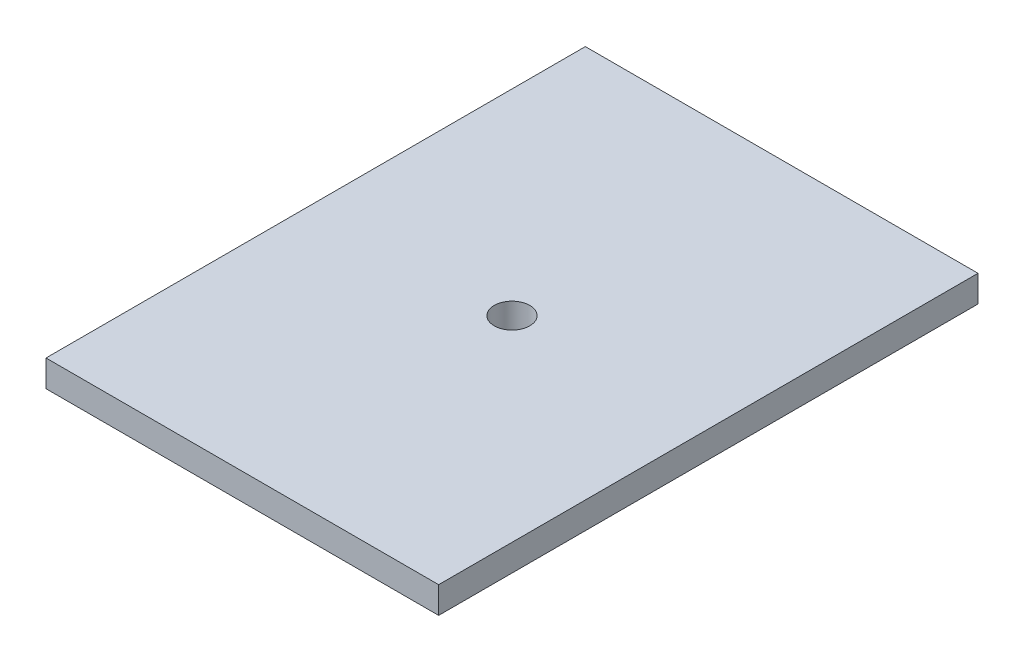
from build123d import *

# Parameters (mm, degrees)
SKIZZE1_W                       = 44.238106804
SKIZZE1_H                       = 60.76547442
LINEAR_AUSTRAGEN1_DEPTH         = 3
SKIZZE2_R                       = 2
SCHNITT_LINEAR_AUSTRAGEN1_DEPTH = 20


with BuildPart() as part:
    # Skizze1 → Linear austragen1 (new body)
    with BuildSketch(Plane(origin=(0, 0, 0), x_dir=(1, 0, 0), z_dir=(0, 1, 0))):
        Rectangle(SKIZZE1_W, SKIZZE1_H)
    extrude(amount=LINEAR_AUSTRAGEN1_DEPTH)

    # Skizze2 → Schnitt-Linear austragen1 (cut)
    with BuildSketch(Plane.XZ):
        with Locations(Location((0, 0, 0), (0, 0, 270))):
            Circle(SKIZZE2_R)
    extrude(amount=-SCHNITT_LINEAR_AUSTRAGEN1_DEPTH, mode=Mode.SUBTRACT)


solid = part.part
